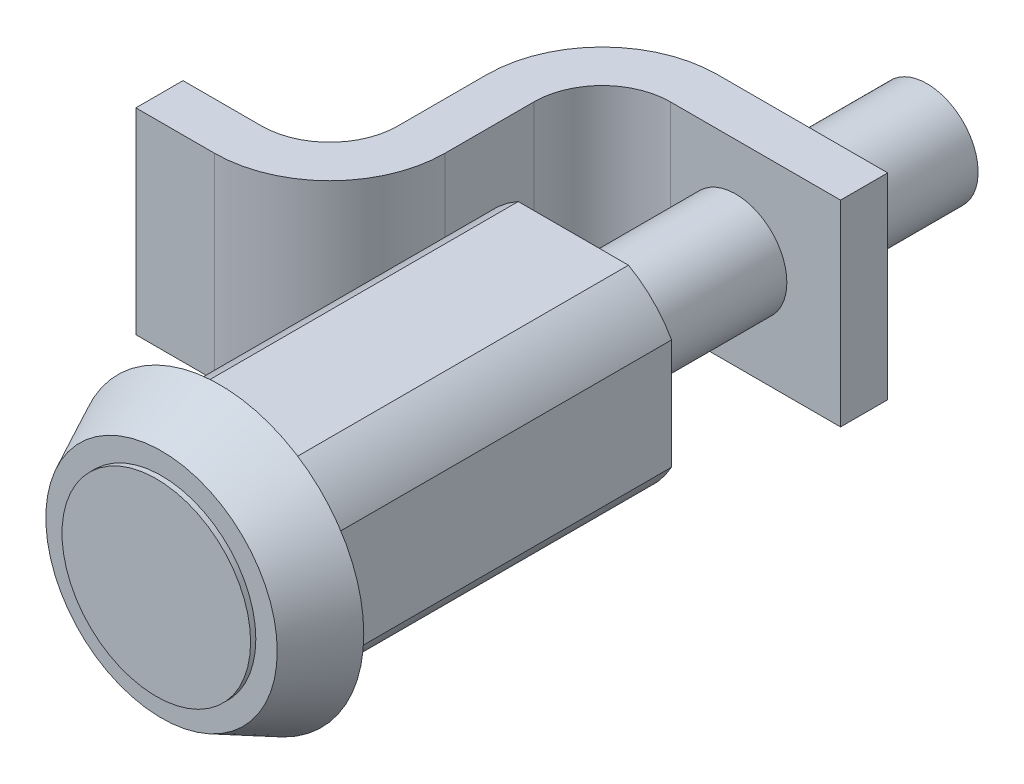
ISO-10303-21;
HEADER;
FILE_DESCRIPTION(('STEP AP214'),'2;1');
FILE_NAME('part.step','',(''),(''),'','','');
FILE_SCHEMA(('AUTOMOTIVE_DESIGN { 1 0 10303 214 1 1 1 1 }'));
ENDSEC;
DATA;
#1=APPLICATION_CONTEXT('core data for automotive mechanical design processes');
#2=APPLICATION_PROTOCOL_DEFINITION('international standard','automotive_design',2000,#1);
#3=PRODUCT_CONTEXT('',#1,'mechanical');
#4=PRODUCT('Part','Part','',(#3));
#5=PRODUCT_RELATED_PRODUCT_CATEGORY('part','',(#4));
#6=PRODUCT_DEFINITION_FORMATION('','',#4);
#7=PRODUCT_DEFINITION_CONTEXT('part definition',#1,'design');
#8=PRODUCT_DEFINITION('design','',#6,#7);
#9=PRODUCT_DEFINITION_SHAPE('','',#8);
#10=(LENGTH_UNIT() NAMED_UNIT(*) SI_UNIT(.MILLI.,.METRE.));
#11=(NAMED_UNIT(*) PLANE_ANGLE_UNIT() SI_UNIT($,.RADIAN.));
#12=(NAMED_UNIT(*) SI_UNIT($,.STERADIAN.) SOLID_ANGLE_UNIT());
#13=UNCERTAINTY_MEASURE_WITH_UNIT(LENGTH_MEASURE(1.E-05),#10,'distance_accuracy_value','');
#14=(GEOMETRIC_REPRESENTATION_CONTEXT(3) GLOBAL_UNCERTAINTY_ASSIGNED_CONTEXT((#13)) GLOBAL_UNIT_ASSIGNED_CONTEXT((#10,
#11,#12)) REPRESENTATION_CONTEXT('',''));
#15=CARTESIAN_POINT('',(0.,0.,0.));
#16=DIRECTION('',(0.,0.,1.));
#17=DIRECTION('',(1.,0.,0.));
#18=AXIS2_PLACEMENT_3D('',#15,#16,#17);
#19=CARTESIAN_POINT('',(0.,0.,0.));
#20=DIRECTION('',(0.,0.,1.));
#21=DIRECTION('',(1.,0.,0.));
#22=AXIS2_PLACEMENT_3D('',#19,#20,#21);
#23=PLANE('',#22);
#24=CARTESIAN_POINT('',(0.,0.,0.));
#25=DIRECTION('',(0.,0.,1.));
#26=DIRECTION('',(1.,0.,0.));
#27=AXIS2_PLACEMENT_3D('',#24,#25,#26);
#28=CIRCLE('',#27,13.97);
#29=CARTESIAN_POINT('',(13.97,0.,0.));
#30=VERTEX_POINT('',#29);
#31=EDGE_CURVE('E343',#30,#30,#28,.T.);
#32=ORIENTED_EDGE('',*,*,#31,.F.);
#33=EDGE_LOOP('',(#32));
#34=FACE_BOUND('',#33,.T.);
#35=CARTESIAN_POINT('',(0.,0.,0.));
#36=DIRECTION('',(0.,0.,-1.));
#37=DIRECTION('',(-1.,0.,0.));
#38=AXIS2_PLACEMENT_3D('',#35,#36,#37);
#39=CIRCLE('',#38,10.922);
#40=CARTESIAN_POINT('',(9.52500000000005,-5.34457285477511,0.));
#41=VERTEX_POINT('',#40);
#42=CARTESIAN_POINT('',(5.3445728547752,-9.525,0.));
#43=VERTEX_POINT('',#42);
#44=EDGE_CURVE('E50',#41,#43,#39,.T.);
#45=ORIENTED_EDGE('',*,*,#44,.F.);
#46=DIRECTION('',(0.,-1.,0.));
#47=VECTOR('',#46,1.);
#48=CARTESIAN_POINT('',(9.52500000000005,-5.34457285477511,0.));
#49=LINE('',#48,#47);
#50=CARTESIAN_POINT('',(9.52499999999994,5.3445728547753,0.));
#51=VERTEX_POINT('',#50);
#52=EDGE_CURVE('E54',#51,#41,#49,.T.);
#53=ORIENTED_EDGE('',*,*,#52,.F.);
#54=CARTESIAN_POINT('',(0.,0.,0.));
#55=DIRECTION('',(0.,0.,-1.));
#56=DIRECTION('',(-1.,0.,0.));
#57=AXIS2_PLACEMENT_3D('',#54,#55,#56);
#58=CIRCLE('',#57,10.922);
#59=CARTESIAN_POINT('',(5.3445728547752,9.525,0.));
#60=VERTEX_POINT('',#59);
#61=EDGE_CURVE('E314',#60,#51,#58,.T.);
#62=ORIENTED_EDGE('',*,*,#61,.F.);
#63=DIRECTION('',(1.,0.,0.));
#64=VECTOR('',#63,1.);
#65=CARTESIAN_POINT('',(5.3445728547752,9.525,0.));
#66=LINE('',#65,#64);
#67=CARTESIAN_POINT('',(-5.34457285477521,9.525,0.));
#68=VERTEX_POINT('',#67);
#69=EDGE_CURVE('E311',#68,#60,#66,.T.);
#70=ORIENTED_EDGE('',*,*,#69,.F.);
#71=CARTESIAN_POINT('',(0.,0.,0.));
#72=DIRECTION('',(0.,0.,-1.));
#73=DIRECTION('',(-1.,0.,0.));
#74=AXIS2_PLACEMENT_3D('',#71,#72,#73);
#75=CIRCLE('',#74,10.922);
#76=CARTESIAN_POINT('',(-9.52500000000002,5.34457285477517,0.));
#77=VERTEX_POINT('',#76);
#78=EDGE_CURVE('E308',#77,#68,#75,.T.);
#79=ORIENTED_EDGE('',*,*,#78,.F.);
#80=DIRECTION('',(0.,1.,0.));
#81=VECTOR('',#80,1.);
#82=CARTESIAN_POINT('',(-9.52500000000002,5.34457285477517,0.));
#83=LINE('',#82,#81);
#84=CARTESIAN_POINT('',(-9.52499999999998,-5.34457285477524,0.));
#85=VERTEX_POINT('',#84);
#86=EDGE_CURVE('E305',#85,#77,#83,.T.);
#87=ORIENTED_EDGE('',*,*,#86,.F.);
#88=CARTESIAN_POINT('',(0.,0.,0.));
#89=DIRECTION('',(0.,0.,-1.));
#90=DIRECTION('',(-1.,0.,0.));
#91=AXIS2_PLACEMENT_3D('',#88,#89,#90);
#92=CIRCLE('',#91,10.922);
#93=CARTESIAN_POINT('',(-5.3445728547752,-9.525,0.));
#94=VERTEX_POINT('',#93);
#95=EDGE_CURVE('E302',#94,#85,#92,.T.);
#96=ORIENTED_EDGE('',*,*,#95,.F.);
#97=DIRECTION('',(-1.,0.,0.));
#98=VECTOR('',#97,1.);
#99=CARTESIAN_POINT('',(-5.3445728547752,-9.525,0.));
#100=LINE('',#99,#98);
#101=EDGE_CURVE('E299',#43,#94,#100,.T.);
#102=ORIENTED_EDGE('',*,*,#101,.F.);
#103=EDGE_LOOP('',(#45,#53,#62,#70,#79,#87,#96,#102));
#104=FACE_BOUND('',#103,.T.);
#105=ADVANCED_FACE('F33',(#34,#104),#23,.F.);
#106=CARTESIAN_POINT('',(0.,0.,0.));
#107=DIRECTION('',(0.,0.,-1.));
#108=DIRECTION('',(1.,0.,0.));
#109=AXIS2_PLACEMENT_3D('',#106,#107,#108);
#110=CONICAL_SURFACE('',#109,13.97,0.453785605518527);
#111=CARTESIAN_POINT('',(0.,0.,5.6388));
#112=DIRECTION('',(0.,0.,1.));
#113=DIRECTION('',(1.,0.,0.));
#114=AXIS2_PLACEMENT_3D('',#111,#112,#113);
#115=CIRCLE('',#114,11.2197734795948);
#116=CARTESIAN_POINT('',(11.2197734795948,0.,5.6388));
#117=VERTEX_POINT('',#116);
#118=EDGE_CURVE('E346',#117,#117,#115,.T.);
#119=ORIENTED_EDGE('',*,*,#118,.F.);
#120=EDGE_LOOP('',(#119));
#121=FACE_BOUND('',#120,.T.);
#122=ORIENTED_EDGE('',*,*,#31,.T.);
#123=EDGE_LOOP('',(#122));
#124=FACE_BOUND('',#123,.T.);
#125=ADVANCED_FACE('F35',(#121,#124),#110,.T.);
#126=CARTESIAN_POINT('',(0.,0.,5.6388));
#127=DIRECTION('',(0.,0.,1.));
#128=DIRECTION('',(1.,0.,0.));
#129=AXIS2_PLACEMENT_3D('',#126,#127,#128);
#130=PLANE('',#129);
#131=CARTESIAN_POINT('',(0.,0.,5.6388));
#132=DIRECTION('',(0.,0.,1.));
#133=DIRECTION('',(1.,0.,0.));
#134=AXIS2_PLACEMENT_3D('',#131,#132,#133);
#135=CIRCLE('',#134,9.144);
#136=CARTESIAN_POINT('',(9.144,0.,5.6388));
#137=VERTEX_POINT('',#136);
#138=EDGE_CURVE('E42',#137,#137,#135,.T.);
#139=ORIENTED_EDGE('',*,*,#138,.F.);
#140=EDGE_LOOP('',(#139));
#141=FACE_BOUND('',#140,.T.);
#142=ORIENTED_EDGE('',*,*,#118,.T.);
#143=EDGE_LOOP('',(#142));
#144=FACE_BOUND('',#143,.T.);
#145=ADVANCED_FACE('F379',(#141,#144),#130,.T.);
#146=CARTESIAN_POINT('',(0.,0.,6.1468));
#147=DIRECTION('',(0.,0.,-1.));
#148=DIRECTION('',(-1.,0.,0.));
#149=AXIS2_PLACEMENT_3D('',#146,#147,#148);
#150=CYLINDRICAL_SURFACE('',#149,9.144);
#151=CARTESIAN_POINT('',(0.,0.,6.1468));
#152=DIRECTION('',(0.,0.,1.));
#153=DIRECTION('',(1.,0.,0.));
#154=AXIS2_PLACEMENT_3D('',#151,#152,#153);
#155=CIRCLE('',#154,9.144);
#156=CARTESIAN_POINT('',(9.144,0.,6.1468));
#157=VERTEX_POINT('',#156);
#158=EDGE_CURVE('E340',#157,#157,#155,.T.);
#159=ORIENTED_EDGE('',*,*,#158,.F.);
#160=EDGE_LOOP('',(#159));
#161=FACE_BOUND('',#160,.T.);
#162=ORIENTED_EDGE('',*,*,#138,.T.);
#163=EDGE_LOOP('',(#162));
#164=FACE_BOUND('',#163,.T.);
#165=ADVANCED_FACE('F385',(#161,#164),#150,.T.);
#166=CARTESIAN_POINT('',(0.,0.,6.1468));
#167=DIRECTION('',(0.,0.,1.));
#168=DIRECTION('',(1.,0.,0.));
#169=AXIS2_PLACEMENT_3D('',#166,#167,#168);
#170=PLANE('',#169);
#171=ORIENTED_EDGE('',*,*,#158,.T.);
#172=EDGE_LOOP('',(#171));
#173=FACE_BOUND('',#172,.T.);
#174=ADVANCED_FACE('F389',(#173),#170,.T.);
#175=CARTESIAN_POINT('',(0.,0.,-34.29));
#176=DIRECTION('',(0.,0.,1.));
#177=DIRECTION('',(1.,0.,0.));
#178=AXIS2_PLACEMENT_3D('',#175,#176,#177);
#179=CYLINDRICAL_SURFACE('',#178,10.922);
#180=ORIENTED_EDGE('',*,*,#44,.T.);
#181=DIRECTION('',(0.,0.,1.));
#182=VECTOR('',#181,1.);
#183=CARTESIAN_POINT('',(5.3445728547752,-9.525,-34.29));
#184=LINE('',#183,#182);
#185=CARTESIAN_POINT('',(5.3445728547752,-9.525,-34.29));
#186=VERTEX_POINT('',#185);
#187=EDGE_CURVE('E337',#186,#43,#184,.T.);
#188=ORIENTED_EDGE('',*,*,#187,.F.);
#189=CARTESIAN_POINT('',(0.,0.,-34.29));
#190=DIRECTION('',(0.,0.,-1.));
#191=DIRECTION('',(-1.,0.,0.));
#192=AXIS2_PLACEMENT_3D('',#189,#190,#191);
#193=CIRCLE('',#192,10.922);
#194=CARTESIAN_POINT('',(9.52500000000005,-5.34457285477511,-34.29));
#195=VERTEX_POINT('',#194);
#196=EDGE_CURVE('E280',#195,#186,#193,.T.);
#197=ORIENTED_EDGE('',*,*,#196,.F.);
#198=DIRECTION('',(0.,0.,1.));
#199=VECTOR('',#198,1.);
#200=CARTESIAN_POINT('',(9.52500000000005,-5.34457285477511,-34.29));
#201=LINE('',#200,#199);
#202=EDGE_CURVE('E297',#195,#41,#201,.T.);
#203=ORIENTED_EDGE('',*,*,#202,.T.);
#204=EDGE_LOOP('',(#180,#188,#197,#203));
#205=FACE_BOUND('',#204,.T.);
#206=ADVANCED_FACE('F393',(#205),#179,.T.);
#207=CARTESIAN_POINT('',(-5.3445728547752,-9.525,-34.29));
#208=DIRECTION('',(0.,1.,0.));
#209=DIRECTION('',(0.,0.,1.));
#210=AXIS2_PLACEMENT_3D('',#207,#208,#209);
#211=PLANE('',#210);
#212=ORIENTED_EDGE('',*,*,#101,.T.);
#213=DIRECTION('',(0.,0.,1.));
#214=VECTOR('',#213,1.);
#215=CARTESIAN_POINT('',(-5.3445728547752,-9.525,-34.29));
#216=LINE('',#215,#214);
#217=CARTESIAN_POINT('',(-5.3445728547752,-9.525,-34.29));
#218=VERTEX_POINT('',#217);
#219=EDGE_CURVE('E334',#218,#94,#216,.T.);
#220=ORIENTED_EDGE('',*,*,#219,.F.);
#221=DIRECTION('',(-1.,0.,0.));
#222=VECTOR('',#221,1.);
#223=CARTESIAN_POINT('',(-5.3445728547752,-9.525,-34.29));
#224=LINE('',#223,#222);
#225=EDGE_CURVE('E283',#186,#218,#224,.T.);
#226=ORIENTED_EDGE('',*,*,#225,.F.);
#227=ORIENTED_EDGE('',*,*,#187,.T.);
#228=EDGE_LOOP('',(#212,#220,#226,#227));
#229=FACE_BOUND('',#228,.T.);
#230=ADVANCED_FACE('F397',(#229),#211,.F.);
#231=CARTESIAN_POINT('',(0.,0.,-34.29));
#232=DIRECTION('',(0.,0.,1.));
#233=DIRECTION('',(1.,0.,0.));
#234=AXIS2_PLACEMENT_3D('',#231,#232,#233);
#235=CYLINDRICAL_SURFACE('',#234,10.922);
#236=ORIENTED_EDGE('',*,*,#95,.T.);
#237=DIRECTION('',(0.,0.,1.));
#238=VECTOR('',#237,1.);
#239=CARTESIAN_POINT('',(-9.52499999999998,-5.34457285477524,-34.29));
#240=LINE('',#239,#238);
#241=CARTESIAN_POINT('',(-9.52499999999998,-5.34457285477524,-34.29));
#242=VERTEX_POINT('',#241);
#243=EDGE_CURVE('E331',#242,#85,#240,.T.);
#244=ORIENTED_EDGE('',*,*,#243,.F.);
#245=CARTESIAN_POINT('',(0.,0.,-34.29));
#246=DIRECTION('',(0.,0.,-1.));
#247=DIRECTION('',(-1.,0.,0.));
#248=AXIS2_PLACEMENT_3D('',#245,#246,#247);
#249=CIRCLE('',#248,10.922);
#250=EDGE_CURVE('E285',#218,#242,#249,.T.);
#251=ORIENTED_EDGE('',*,*,#250,.F.);
#252=ORIENTED_EDGE('',*,*,#219,.T.);
#253=EDGE_LOOP('',(#236,#244,#251,#252));
#254=FACE_BOUND('',#253,.T.);
#255=ADVANCED_FACE('F401',(#254),#235,.T.);
#256=CARTESIAN_POINT('',(-9.52500000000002,5.34457285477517,-34.29));
#257=DIRECTION('',(1.,0.,0.));
#258=DIRECTION('',(0.,1.,0.));
#259=AXIS2_PLACEMENT_3D('',#256,#257,#258);
#260=PLANE('',#259);
#261=ORIENTED_EDGE('',*,*,#86,.T.);
#262=DIRECTION('',(0.,0.,1.));
#263=VECTOR('',#262,1.);
#264=CARTESIAN_POINT('',(-9.52500000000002,5.34457285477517,-34.29));
#265=LINE('',#264,#263);
#266=CARTESIAN_POINT('',(-9.52500000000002,5.34457285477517,-34.29));
#267=VERTEX_POINT('',#266);
#268=EDGE_CURVE('E328',#267,#77,#265,.T.);
#269=ORIENTED_EDGE('',*,*,#268,.F.);
#270=DIRECTION('',(0.,1.,0.));
#271=VECTOR('',#270,1.);
#272=CARTESIAN_POINT('',(-9.52500000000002,5.34457285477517,-34.29));
#273=LINE('',#272,#271);
#274=EDGE_CURVE('E287',#242,#267,#273,.T.);
#275=ORIENTED_EDGE('',*,*,#274,.F.);
#276=ORIENTED_EDGE('',*,*,#243,.T.);
#277=EDGE_LOOP('',(#261,#269,#275,#276));
#278=FACE_BOUND('',#277,.T.);
#279=ADVANCED_FACE('F405',(#278),#260,.F.);
#280=CARTESIAN_POINT('',(0.,0.,-34.29));
#281=DIRECTION('',(0.,0.,1.));
#282=DIRECTION('',(1.,0.,0.));
#283=AXIS2_PLACEMENT_3D('',#280,#281,#282);
#284=CYLINDRICAL_SURFACE('',#283,10.922);
#285=ORIENTED_EDGE('',*,*,#78,.T.);
#286=DIRECTION('',(0.,0.,1.));
#287=VECTOR('',#286,1.);
#288=CARTESIAN_POINT('',(-5.34457285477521,9.525,-34.29));
#289=LINE('',#288,#287);
#290=CARTESIAN_POINT('',(-5.34457285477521,9.525,-34.29));
#291=VERTEX_POINT('',#290);
#292=EDGE_CURVE('E325',#291,#68,#289,.T.);
#293=ORIENTED_EDGE('',*,*,#292,.F.);
#294=CARTESIAN_POINT('',(0.,0.,-34.29));
#295=DIRECTION('',(0.,0.,-1.));
#296=DIRECTION('',(-1.,0.,0.));
#297=AXIS2_PLACEMENT_3D('',#294,#295,#296);
#298=CIRCLE('',#297,10.922);
#299=EDGE_CURVE('E289',#267,#291,#298,.T.);
#300=ORIENTED_EDGE('',*,*,#299,.F.);
#301=ORIENTED_EDGE('',*,*,#268,.T.);
#302=EDGE_LOOP('',(#285,#293,#300,#301));
#303=FACE_BOUND('',#302,.T.);
#304=ADVANCED_FACE('F409',(#303),#284,.T.);
#305=CARTESIAN_POINT('',(5.3445728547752,9.525,-34.29));
#306=DIRECTION('',(0.,-1.,0.));
#307=DIRECTION('',(0.,0.,-1.));
#308=AXIS2_PLACEMENT_3D('',#305,#306,#307);
#309=PLANE('',#308);
#310=ORIENTED_EDGE('',*,*,#69,.T.);
#311=DIRECTION('',(0.,0.,1.));
#312=VECTOR('',#311,1.);
#313=CARTESIAN_POINT('',(5.3445728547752,9.525,-34.29));
#314=LINE('',#313,#312);
#315=CARTESIAN_POINT('',(5.3445728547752,9.525,-34.29));
#316=VERTEX_POINT('',#315);
#317=EDGE_CURVE('E322',#316,#60,#314,.T.);
#318=ORIENTED_EDGE('',*,*,#317,.F.);
#319=DIRECTION('',(1.,0.,0.));
#320=VECTOR('',#319,1.);
#321=CARTESIAN_POINT('',(5.3445728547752,9.525,-34.29));
#322=LINE('',#321,#320);
#323=EDGE_CURVE('E291',#291,#316,#322,.T.);
#324=ORIENTED_EDGE('',*,*,#323,.F.);
#325=ORIENTED_EDGE('',*,*,#292,.T.);
#326=EDGE_LOOP('',(#310,#318,#324,#325));
#327=FACE_BOUND('',#326,.T.);
#328=ADVANCED_FACE('F413',(#327),#309,.F.);
#329=CARTESIAN_POINT('',(0.,0.,-34.29));
#330=DIRECTION('',(0.,0.,1.));
#331=DIRECTION('',(1.,0.,0.));
#332=AXIS2_PLACEMENT_3D('',#329,#330,#331);
#333=CYLINDRICAL_SURFACE('',#332,10.922);
#334=ORIENTED_EDGE('',*,*,#61,.T.);
#335=DIRECTION('',(0.,0.,1.));
#336=VECTOR('',#335,1.);
#337=CARTESIAN_POINT('',(9.52499999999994,5.3445728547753,-34.29));
#338=LINE('',#337,#336);
#339=CARTESIAN_POINT('',(9.52499999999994,5.3445728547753,-34.29));
#340=VERTEX_POINT('',#339);
#341=EDGE_CURVE('E319',#340,#51,#338,.T.);
#342=ORIENTED_EDGE('',*,*,#341,.F.);
#343=CARTESIAN_POINT('',(0.,0.,-34.29));
#344=DIRECTION('',(0.,0.,-1.));
#345=DIRECTION('',(-1.,0.,0.));
#346=AXIS2_PLACEMENT_3D('',#343,#344,#345);
#347=CIRCLE('',#346,10.922);
#348=EDGE_CURVE('E293',#316,#340,#347,.T.);
#349=ORIENTED_EDGE('',*,*,#348,.F.);
#350=ORIENTED_EDGE('',*,*,#317,.T.);
#351=EDGE_LOOP('',(#334,#342,#349,#350));
#352=FACE_BOUND('',#351,.T.);
#353=ADVANCED_FACE('F417',(#352),#333,.T.);
#354=CARTESIAN_POINT('',(9.52500000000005,-5.34457285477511,-34.29));
#355=DIRECTION('',(-1.,0.,0.));
#356=DIRECTION('',(0.,-1.,0.));
#357=AXIS2_PLACEMENT_3D('',#354,#355,#356);
#358=PLANE('',#357);
#359=ORIENTED_EDGE('',*,*,#52,.T.);
#360=ORIENTED_EDGE('',*,*,#202,.F.);
#361=DIRECTION('',(0.,-1.,0.));
#362=VECTOR('',#361,1.);
#363=CARTESIAN_POINT('',(9.52500000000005,-5.34457285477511,-34.29));
#364=LINE('',#363,#362);
#365=EDGE_CURVE('E295',#340,#195,#364,.T.);
#366=ORIENTED_EDGE('',*,*,#365,.F.);
#367=ORIENTED_EDGE('',*,*,#341,.T.);
#368=EDGE_LOOP('',(#359,#360,#366,#367));
#369=FACE_BOUND('',#368,.T.);
#370=ADVANCED_FACE('F421',(#369),#358,.F.);
#371=CARTESIAN_POINT('',(0.,0.,-34.29));
#372=DIRECTION('',(0.,0.,-1.));
#373=DIRECTION('',(-1.,0.,0.));
#374=AXIS2_PLACEMENT_3D('',#371,#372,#373);
#375=PLANE('',#374);
#376=CARTESIAN_POINT('',(0.,0.,-34.29));
#377=DIRECTION('',(0.,0.,-1.));
#378=DIRECTION('',(-1.,0.,0.));
#379=AXIS2_PLACEMENT_3D('',#376,#377,#378);
#380=CIRCLE('',#379,4.953);
#381=CARTESIAN_POINT('',(-4.953,0.,-34.29));
#382=VERTEX_POINT('',#381);
#383=EDGE_CURVE('E11',#382,#382,#380,.T.);
#384=ORIENTED_EDGE('',*,*,#383,.F.);
#385=EDGE_LOOP('',(#384));
#386=FACE_BOUND('',#385,.T.);
#387=ORIENTED_EDGE('',*,*,#196,.T.);
#388=ORIENTED_EDGE('',*,*,#225,.T.);
#389=ORIENTED_EDGE('',*,*,#250,.T.);
#390=ORIENTED_EDGE('',*,*,#274,.T.);
#391=ORIENTED_EDGE('',*,*,#299,.T.);
#392=ORIENTED_EDGE('',*,*,#323,.T.);
#393=ORIENTED_EDGE('',*,*,#348,.T.);
#394=ORIENTED_EDGE('',*,*,#365,.T.);
#395=EDGE_LOOP('',(#387,#388,#389,#390,#391,#392,#393,#394));
#396=FACE_BOUND('',#395,.T.);
#397=ADVANCED_FACE('F370',(#386,#396),#375,.T.);
#398=CARTESIAN_POINT('',(0.,0.,-68.58));
#399=DIRECTION('',(0.,0.,1.));
#400=DIRECTION('',(1.,0.,0.));
#401=AXIS2_PLACEMENT_3D('',#398,#399,#400);
#402=CYLINDRICAL_SURFACE('',#401,4.953);
#403=CARTESIAN_POINT('',(0.,0.,-50.038));
#404=DIRECTION('',(0.,0.,1.));
#405=DIRECTION('',(1.,0.,0.));
#406=AXIS2_PLACEMENT_3D('',#403,#404,#405);
#407=CIRCLE('',#406,4.953);
#408=CARTESIAN_POINT('',(4.953,0.,-50.038));
#409=VERTEX_POINT('',#408);
#410=EDGE_CURVE('E257',#409,#409,#407,.T.);
#411=ORIENTED_EDGE('',*,*,#410,.T.);
#412=EDGE_LOOP('',(#411));
#413=FACE_BOUND('',#412,.T.);
#414=ORIENTED_EDGE('',*,*,#383,.T.);
#415=EDGE_LOOP('',(#414));
#416=FACE_BOUND('',#415,.T.);
#417=ADVANCED_FACE('F361',(#413,#416),#402,.T.);
#418=CARTESIAN_POINT('',(-6.35,-9.525,-54.61));
#419=DIRECTION('',(0.,0.,-1.));
#420=DIRECTION('',(-1.,0.,0.));
#421=AXIS2_PLACEMENT_3D('',#418,#419,#420);
#422=PLANE('',#421);
#423=CARTESIAN_POINT('',(0.,0.,-54.61));
#424=DIRECTION('',(0.,0.,-1.));
#425=DIRECTION('',(-1.,0.,0.));
#426=AXIS2_PLACEMENT_3D('',#423,#424,#425);
#427=CIRCLE('',#426,4.953);
#428=CARTESIAN_POINT('',(-4.953,0.,-54.61));
#429=VERTEX_POINT('',#428);
#430=EDGE_CURVE('E37',#429,#429,#427,.T.);
#431=ORIENTED_EDGE('',*,*,#430,.F.);
#432=EDGE_LOOP('',(#431));
#433=FACE_BOUND('',#432,.T.);
#434=DIRECTION('',(0.,1.,0.));
#435=VECTOR('',#434,1.);
#436=CARTESIAN_POINT('',(-6.35,-9.525,-54.61));
#437=LINE('',#436,#435);
#438=CARTESIAN_POINT('',(-6.35,-9.525,-54.61));
#439=VERTEX_POINT('',#438);
#440=CARTESIAN_POINT('',(-6.35,9.525,-54.61));
#441=VERTEX_POINT('',#440);
#442=EDGE_CURVE('E170',#439,#441,#437,.T.);
#443=ORIENTED_EDGE('',*,*,#442,.T.);
#444=DIRECTION('',(-1.,0.,0.));
#445=VECTOR('',#444,1.);
#446=CARTESIAN_POINT('',(-6.35,9.525,-54.61));
#447=LINE('',#446,#445);
#448=CARTESIAN_POINT('',(10.16,9.525,-54.61));
#449=VERTEX_POINT('',#448);
#450=EDGE_CURVE('E174',#449,#441,#447,.T.);
#451=ORIENTED_EDGE('',*,*,#450,.F.);
#452=DIRECTION('',(0.,1.,0.));
#453=VECTOR('',#452,1.);
#454=CARTESIAN_POINT('',(10.16,-9.525,-54.61));
#455=LINE('',#454,#453);
#456=CARTESIAN_POINT('',(10.16,-9.525,-54.61));
#457=VERTEX_POINT('',#456);
#458=EDGE_CURVE('E255',#457,#449,#455,.T.);
#459=ORIENTED_EDGE('',*,*,#458,.F.);
#460=DIRECTION('',(-1.,0.,0.));
#461=VECTOR('',#460,1.);
#462=CARTESIAN_POINT('',(-6.35,-9.525,-54.61));
#463=LINE('',#462,#461);
#464=EDGE_CURVE('E176',#457,#439,#463,.T.);
#465=ORIENTED_EDGE('',*,*,#464,.T.);
#466=EDGE_LOOP('',(#443,#451,#459,#465));
#467=FACE_BOUND('',#466,.T.);
#468=ADVANCED_FACE('F172',(#433,#467),#422,.T.);
#469=CARTESIAN_POINT('',(10.16,-9.525,-54.61));
#470=DIRECTION('',(1.,0.,0.));
#471=DIRECTION('',(0.,0.,-1.));
#472=AXIS2_PLACEMENT_3D('',#469,#470,#471);
#473=PLANE('',#472);
#474=ORIENTED_EDGE('',*,*,#458,.T.);
#475=DIRECTION('',(0.,0.,-1.));
#476=VECTOR('',#475,1.);
#477=CARTESIAN_POINT('',(10.16,9.525,-54.61));
#478=LINE('',#477,#476);
#479=CARTESIAN_POINT('',(10.16,9.525,-50.038));
#480=VERTEX_POINT('',#479);
#481=EDGE_CURVE('E195',#480,#449,#478,.T.);
#482=ORIENTED_EDGE('',*,*,#481,.F.);
#483=DIRECTION('',(0.,1.,0.));
#484=VECTOR('',#483,1.);
#485=CARTESIAN_POINT('',(10.16,-9.525,-50.038));
#486=LINE('',#485,#484);
#487=CARTESIAN_POINT('',(10.16,-9.525,-50.038));
#488=VERTEX_POINT('',#487);
#489=EDGE_CURVE('E258',#488,#480,#486,.T.);
#490=ORIENTED_EDGE('',*,*,#489,.F.);
#491=DIRECTION('',(0.,0.,-1.));
#492=VECTOR('',#491,1.);
#493=CARTESIAN_POINT('',(10.16,-9.525,-54.61));
#494=LINE('',#493,#492);
#495=EDGE_CURVE('E181',#488,#457,#494,.T.);
#496=ORIENTED_EDGE('',*,*,#495,.T.);
#497=EDGE_LOOP('',(#474,#482,#490,#496));
#498=FACE_BOUND('',#497,.T.);
#499=ADVANCED_FACE('F360',(#498),#473,.T.);
#500=CARTESIAN_POINT('',(10.16,-9.525,-50.038));
#501=DIRECTION('',(0.,0.,1.));
#502=DIRECTION('',(1.,0.,0.));
#503=AXIS2_PLACEMENT_3D('',#500,#501,#502);
#504=PLANE('',#503);
#505=ORIENTED_EDGE('',*,*,#410,.F.);
#506=EDGE_LOOP('',(#505));
#507=FACE_BOUND('',#506,.T.);
#508=ORIENTED_EDGE('',*,*,#489,.T.);
#509=DIRECTION('',(1.,0.,0.));
#510=VECTOR('',#509,1.);
#511=CARTESIAN_POINT('',(10.16,9.525,-50.038));
#512=LINE('',#511,#510);
#513=CARTESIAN_POINT('',(-6.35,9.525,-50.038));
#514=VERTEX_POINT('',#513);
#515=EDGE_CURVE('E220',#514,#480,#512,.T.);
#516=ORIENTED_EDGE('',*,*,#515,.F.);
#517=DIRECTION('',(0.,1.,0.));
#518=VECTOR('',#517,1.);
#519=CARTESIAN_POINT('',(-6.35,-9.525,-50.038));
#520=LINE('',#519,#518);
#521=CARTESIAN_POINT('',(-6.35,-9.525,-50.038));
#522=VERTEX_POINT('',#521);
#523=EDGE_CURVE('E260',#522,#514,#520,.T.);
#524=ORIENTED_EDGE('',*,*,#523,.F.);
#525=DIRECTION('',(1.,0.,0.));
#526=VECTOR('',#525,1.);
#527=CARTESIAN_POINT('',(10.16,-9.525,-50.038));
#528=LINE('',#527,#526);
#529=EDGE_CURVE('E250',#522,#488,#528,.T.);
#530=ORIENTED_EDGE('',*,*,#529,.T.);
#531=EDGE_LOOP('',(#508,#516,#524,#530));
#532=FACE_BOUND('',#531,.T.);
#533=ADVANCED_FACE('F367',(#507,#532),#504,.T.);
#534=CARTESIAN_POINT('',(-6.35,-9.525,-43.434));
#535=DIRECTION('',(0.,1.,0.));
#536=DIRECTION('',(0.,0.,1.));
#537=AXIS2_PLACEMENT_3D('',#534,#535,#536);
#538=CYLINDRICAL_SURFACE('',#537,6.604);
#539=ORIENTED_EDGE('',*,*,#523,.T.);
#540=CARTESIAN_POINT('',(-6.35,9.525,-43.434));
#541=DIRECTION('',(0.,-1.,0.));
#542=DIRECTION('',(0.,0.,-1.));
#543=AXIS2_PLACEMENT_3D('',#540,#541,#542);
#544=CIRCLE('',#543,6.604);
#545=CARTESIAN_POINT('',(-12.954,9.525,-43.434));
#546=VERTEX_POINT('',#545);
#547=EDGE_CURVE('E217',#546,#514,#544,.T.);
#548=ORIENTED_EDGE('',*,*,#547,.F.);
#549=DIRECTION('',(0.,1.,0.));
#550=VECTOR('',#549,1.);
#551=CARTESIAN_POINT('',(-12.954,-9.525,-43.434));
#552=LINE('',#551,#550);
#553=CARTESIAN_POINT('',(-12.954,-9.525,-43.434));
#554=VERTEX_POINT('',#553);
#555=EDGE_CURVE('E262',#554,#546,#552,.T.);
#556=ORIENTED_EDGE('',*,*,#555,.F.);
#557=CARTESIAN_POINT('',(-6.35,-9.525,-43.434));
#558=DIRECTION('',(0.,-1.,0.));
#559=DIRECTION('',(0.,0.,-1.));
#560=AXIS2_PLACEMENT_3D('',#557,#558,#559);
#561=CIRCLE('',#560,6.604);
#562=EDGE_CURVE('E247',#554,#522,#561,.T.);
#563=ORIENTED_EDGE('',*,*,#562,.T.);
#564=EDGE_LOOP('',(#539,#548,#556,#563));
#565=FACE_BOUND('',#564,.T.);
#566=ADVANCED_FACE('F446',(#565),#538,.F.);
#567=CARTESIAN_POINT('',(-12.954,-9.525,-34.798));
#568=DIRECTION('',(1.,0.,0.));
#569=DIRECTION('',(0.,0.,-1.));
#570=AXIS2_PLACEMENT_3D('',#567,#568,#569);
#571=PLANE('',#570);
#572=ORIENTED_EDGE('',*,*,#555,.T.);
#573=DIRECTION('',(0.,0.,-1.));
#574=VECTOR('',#573,1.);
#575=CARTESIAN_POINT('',(-12.954,9.525,-34.798));
#576=LINE('',#575,#574);
#577=CARTESIAN_POINT('',(-12.954,9.525,-34.798));
#578=VERTEX_POINT('',#577);
#579=EDGE_CURVE('E214',#578,#546,#576,.T.);
#580=ORIENTED_EDGE('',*,*,#579,.F.);
#581=DIRECTION('',(0.,1.,0.));
#582=VECTOR('',#581,1.);
#583=CARTESIAN_POINT('',(-12.954,-9.525,-34.798));
#584=LINE('',#583,#582);
#585=CARTESIAN_POINT('',(-12.954,-9.525,-34.798));
#586=VERTEX_POINT('',#585);
#587=EDGE_CURVE('E264',#586,#578,#584,.T.);
#588=ORIENTED_EDGE('',*,*,#587,.F.);
#589=DIRECTION('',(0.,0.,-1.));
#590=VECTOR('',#589,1.);
#591=CARTESIAN_POINT('',(-12.954,-9.525,-34.798));
#592=LINE('',#591,#590);
#593=EDGE_CURVE('E244',#586,#554,#592,.T.);
#594=ORIENTED_EDGE('',*,*,#593,.T.);
#595=EDGE_LOOP('',(#572,#580,#588,#594));
#596=FACE_BOUND('',#595,.T.);
#597=ADVANCED_FACE('F450',(#596),#571,.T.);
#598=CARTESIAN_POINT('',(-24.13,-9.525,-34.798));
#599=DIRECTION('',(0.,1.,0.));
#600=DIRECTION('',(0.,0.,1.));
#601=AXIS2_PLACEMENT_3D('',#598,#599,#600);
#602=CYLINDRICAL_SURFACE('',#601,11.176);
#603=ORIENTED_EDGE('',*,*,#587,.T.);
#604=CARTESIAN_POINT('',(-24.13,9.525,-34.798));
#605=DIRECTION('',(0.,1.,0.));
#606=DIRECTION('',(0.,0.,-1.));
#607=AXIS2_PLACEMENT_3D('',#604,#605,#606);
#608=CIRCLE('',#607,11.176);
#609=CARTESIAN_POINT('',(-24.13,9.525,-23.622));
#610=VERTEX_POINT('',#609);
#611=EDGE_CURVE('E211',#610,#578,#608,.T.);
#612=ORIENTED_EDGE('',*,*,#611,.F.);
#613=DIRECTION('',(0.,1.,0.));
#614=VECTOR('',#613,1.);
#615=CARTESIAN_POINT('',(-24.13,-9.525,-23.622));
#616=LINE('',#615,#614);
#617=CARTESIAN_POINT('',(-24.13,-9.525,-23.622));
#618=VERTEX_POINT('',#617);
#619=EDGE_CURVE('E266',#618,#610,#616,.T.);
#620=ORIENTED_EDGE('',*,*,#619,.F.);
#621=CARTESIAN_POINT('',(-24.13,-9.525,-34.798));
#622=DIRECTION('',(0.,1.,0.));
#623=DIRECTION('',(0.,0.,-1.));
#624=AXIS2_PLACEMENT_3D('',#621,#622,#623);
#625=CIRCLE('',#624,11.176);
#626=EDGE_CURVE('E241',#618,#586,#625,.T.);
#627=ORIENTED_EDGE('',*,*,#626,.T.);
#628=EDGE_LOOP('',(#603,#612,#620,#627));
#629=FACE_BOUND('',#628,.T.);
#630=ADVANCED_FACE('F454',(#629),#602,.T.);
#631=CARTESIAN_POINT('',(-24.13,-9.525,-23.622));
#632=DIRECTION('',(0.,0.,1.));
#633=DIRECTION('',(1.,0.,0.));
#634=AXIS2_PLACEMENT_3D('',#631,#632,#633);
#635=PLANE('',#634);
#636=ORIENTED_EDGE('',*,*,#619,.T.);
#637=DIRECTION('',(1.,0.,0.));
#638=VECTOR('',#637,1.);
#639=CARTESIAN_POINT('',(-24.13,9.525,-23.622));
#640=LINE('',#639,#638);
#641=CARTESIAN_POINT('',(-31.75,9.525,-23.622));
#642=VERTEX_POINT('',#641);
#643=EDGE_CURVE('E208',#642,#610,#640,.T.);
#644=ORIENTED_EDGE('',*,*,#643,.F.);
#645=DIRECTION('',(0.,1.,0.));
#646=VECTOR('',#645,1.);
#647=CARTESIAN_POINT('',(-31.75,-9.525,-23.622));
#648=LINE('',#647,#646);
#649=CARTESIAN_POINT('',(-31.75,-9.525,-23.622));
#650=VERTEX_POINT('',#649);
#651=EDGE_CURVE('E268',#650,#642,#648,.T.);
#652=ORIENTED_EDGE('',*,*,#651,.F.);
#653=DIRECTION('',(1.,0.,0.));
#654=VECTOR('',#653,1.);
#655=CARTESIAN_POINT('',(-24.13,-9.525,-23.622));
#656=LINE('',#655,#654);
#657=EDGE_CURVE('E238',#650,#618,#656,.T.);
#658=ORIENTED_EDGE('',*,*,#657,.T.);
#659=EDGE_LOOP('',(#636,#644,#652,#658));
#660=FACE_BOUND('',#659,.T.);
#661=ADVANCED_FACE('F458',(#660),#635,.T.);
#662=CARTESIAN_POINT('',(-31.75,-9.525,-23.622));
#663=DIRECTION('',(-1.,0.,0.));
#664=DIRECTION('',(0.,0.,1.));
#665=AXIS2_PLACEMENT_3D('',#662,#663,#664);
#666=PLANE('',#665);
#667=ORIENTED_EDGE('',*,*,#651,.T.);
#668=DIRECTION('',(0.,0.,1.));
#669=VECTOR('',#668,1.);
#670=CARTESIAN_POINT('',(-31.75,9.525,-23.622));
#671=LINE('',#670,#669);
#672=CARTESIAN_POINT('',(-31.75,9.525,-28.194));
#673=VERTEX_POINT('',#672);
#674=EDGE_CURVE('E205',#673,#642,#671,.T.);
#675=ORIENTED_EDGE('',*,*,#674,.F.);
#676=DIRECTION('',(0.,1.,0.));
#677=VECTOR('',#676,1.);
#678=CARTESIAN_POINT('',(-31.75,-9.525,-28.194));
#679=LINE('',#678,#677);
#680=CARTESIAN_POINT('',(-31.75,-9.525,-28.194));
#681=VERTEX_POINT('',#680);
#682=EDGE_CURVE('E270',#681,#673,#679,.T.);
#683=ORIENTED_EDGE('',*,*,#682,.F.);
#684=DIRECTION('',(0.,0.,1.));
#685=VECTOR('',#684,1.);
#686=CARTESIAN_POINT('',(-31.75,-9.525,-23.622));
#687=LINE('',#686,#685);
#688=EDGE_CURVE('E235',#681,#650,#687,.T.);
#689=ORIENTED_EDGE('',*,*,#688,.T.);
#690=EDGE_LOOP('',(#667,#675,#683,#689));
#691=FACE_BOUND('',#690,.T.);
#692=ADVANCED_FACE('F462',(#691),#666,.T.);
#693=CARTESIAN_POINT('',(-31.75,-9.525,-28.194));
#694=DIRECTION('',(0.,0.,-1.));
#695=DIRECTION('',(-1.,0.,0.));
#696=AXIS2_PLACEMENT_3D('',#693,#694,#695);
#697=PLANE('',#696);
#698=ORIENTED_EDGE('',*,*,#682,.T.);
#699=DIRECTION('',(-1.,0.,0.));
#700=VECTOR('',#699,1.);
#701=CARTESIAN_POINT('',(-31.75,9.525,-28.194));
#702=LINE('',#701,#700);
#703=CARTESIAN_POINT('',(-24.13,9.525,-28.194));
#704=VERTEX_POINT('',#703);
#705=EDGE_CURVE('E202',#704,#673,#702,.T.);
#706=ORIENTED_EDGE('',*,*,#705,.F.);
#707=DIRECTION('',(0.,1.,0.));
#708=VECTOR('',#707,1.);
#709=CARTESIAN_POINT('',(-24.13,-9.525,-28.194));
#710=LINE('',#709,#708);
#711=CARTESIAN_POINT('',(-24.13,-9.525,-28.194));
#712=VERTEX_POINT('',#711);
#713=EDGE_CURVE('E272',#712,#704,#710,.T.);
#714=ORIENTED_EDGE('',*,*,#713,.F.);
#715=DIRECTION('',(-1.,0.,0.));
#716=VECTOR('',#715,1.);
#717=CARTESIAN_POINT('',(-31.75,-9.525,-28.194));
#718=LINE('',#717,#716);
#719=EDGE_CURVE('E232',#712,#681,#718,.T.);
#720=ORIENTED_EDGE('',*,*,#719,.T.);
#721=EDGE_LOOP('',(#698,#706,#714,#720));
#722=FACE_BOUND('',#721,.T.);
#723=ADVANCED_FACE('F466',(#722),#697,.T.);
#724=CARTESIAN_POINT('',(-24.13,-9.525,-34.798));
#725=DIRECTION('',(0.,1.,0.));
#726=DIRECTION('',(0.,0.,1.));
#727=AXIS2_PLACEMENT_3D('',#724,#725,#726);
#728=CYLINDRICAL_SURFACE('',#727,6.60400000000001);
#729=ORIENTED_EDGE('',*,*,#713,.T.);
#730=CARTESIAN_POINT('',(-24.13,9.525,-34.798));
#731=DIRECTION('',(0.,-1.,0.));
#732=DIRECTION('',(0.,0.,1.));
#733=AXIS2_PLACEMENT_3D('',#730,#731,#732);
#734=CIRCLE('',#733,6.60400000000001);
#735=CARTESIAN_POINT('',(-17.526,9.525,-34.798));
#736=VERTEX_POINT('',#735);
#737=EDGE_CURVE('E199',#736,#704,#734,.T.);
#738=ORIENTED_EDGE('',*,*,#737,.F.);
#739=DIRECTION('',(0.,1.,0.));
#740=VECTOR('',#739,1.);
#741=CARTESIAN_POINT('',(-17.526,-9.525,-34.798));
#742=LINE('',#741,#740);
#743=CARTESIAN_POINT('',(-17.526,-9.525,-34.798));
#744=VERTEX_POINT('',#743);
#745=EDGE_CURVE('E274',#744,#736,#742,.T.);
#746=ORIENTED_EDGE('',*,*,#745,.F.);
#747=CARTESIAN_POINT('',(-24.13,-9.525,-34.798));
#748=DIRECTION('',(0.,-1.,0.));
#749=DIRECTION('',(0.,0.,1.));
#750=AXIS2_PLACEMENT_3D('',#747,#748,#749);
#751=CIRCLE('',#750,6.60400000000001);
#752=EDGE_CURVE('E229',#744,#712,#751,.T.);
#753=ORIENTED_EDGE('',*,*,#752,.T.);
#754=EDGE_LOOP('',(#729,#738,#746,#753));
#755=FACE_BOUND('',#754,.T.);
#756=ADVANCED_FACE('F470',(#755),#728,.F.);
#757=CARTESIAN_POINT('',(-17.526,-9.525,-34.798));
#758=DIRECTION('',(-1.,0.,0.));
#759=DIRECTION('',(0.,0.,1.));
#760=AXIS2_PLACEMENT_3D('',#757,#758,#759);
#761=PLANE('',#760);
#762=ORIENTED_EDGE('',*,*,#745,.T.);
#763=DIRECTION('',(0.,0.,1.));
#764=VECTOR('',#763,1.);
#765=CARTESIAN_POINT('',(-17.526,9.525,-34.798));
#766=LINE('',#765,#764);
#767=CARTESIAN_POINT('',(-17.526,9.525,-43.434));
#768=VERTEX_POINT('',#767);
#769=EDGE_CURVE('E189',#768,#736,#766,.T.);
#770=ORIENTED_EDGE('',*,*,#769,.F.);
#771=DIRECTION('',(0.,1.,0.));
#772=VECTOR('',#771,1.);
#773=CARTESIAN_POINT('',(-17.526,-9.525,-43.434));
#774=LINE('',#773,#772);
#775=CARTESIAN_POINT('',(-17.526,-9.525,-43.434));
#776=VERTEX_POINT('',#775);
#777=EDGE_CURVE('E180',#776,#768,#774,.T.);
#778=ORIENTED_EDGE('',*,*,#777,.F.);
#779=DIRECTION('',(0.,0.,1.));
#780=VECTOR('',#779,1.);
#781=CARTESIAN_POINT('',(-17.526,-9.525,-34.798));
#782=LINE('',#781,#780);
#783=EDGE_CURVE('E226',#776,#744,#782,.T.);
#784=ORIENTED_EDGE('',*,*,#783,.T.);
#785=EDGE_LOOP('',(#762,#770,#778,#784));
#786=FACE_BOUND('',#785,.T.);
#787=ADVANCED_FACE('F474',(#786),#761,.T.);
#788=CARTESIAN_POINT('',(-6.35,-9.525,-43.434));
#789=DIRECTION('',(0.,1.,0.));
#790=DIRECTION('',(0.,0.,1.));
#791=AXIS2_PLACEMENT_3D('',#788,#789,#790);
#792=CYLINDRICAL_SURFACE('',#791,11.176);
#793=ORIENTED_EDGE('',*,*,#777,.T.);
#794=CARTESIAN_POINT('',(-6.35,9.525,-43.434));
#795=DIRECTION('',(0.,1.,0.));
#796=DIRECTION('',(0.,0.,-1.));
#797=AXIS2_PLACEMENT_3D('',#794,#795,#796);
#798=CIRCLE('',#797,11.176);
#799=EDGE_CURVE('E184',#441,#768,#798,.T.);
#800=ORIENTED_EDGE('',*,*,#799,.F.);
#801=ORIENTED_EDGE('',*,*,#442,.F.);
#802=CARTESIAN_POINT('',(-6.35,-9.525,-43.434));
#803=DIRECTION('',(0.,1.,0.));
#804=DIRECTION('',(0.,0.,-1.));
#805=AXIS2_PLACEMENT_3D('',#802,#803,#804);
#806=CIRCLE('',#805,11.176);
#807=EDGE_CURVE('E224',#439,#776,#806,.T.);
#808=ORIENTED_EDGE('',*,*,#807,.T.);
#809=EDGE_LOOP('',(#793,#800,#801,#808));
#810=FACE_BOUND('',#809,.T.);
#811=ADVANCED_FACE('F185',(#810),#792,.T.);
#812=CARTESIAN_POINT('',(-6.35,-9.525,-43.434));
#813=DIRECTION('',(0.,-1.,0.));
#814=DIRECTION('',(0.,0.,-1.));
#815=AXIS2_PLACEMENT_3D('',#812,#813,#814);
#816=PLANE('',#815);
#817=ORIENTED_EDGE('',*,*,#464,.F.);
#818=ORIENTED_EDGE('',*,*,#495,.F.);
#819=ORIENTED_EDGE('',*,*,#529,.F.);
#820=ORIENTED_EDGE('',*,*,#562,.F.);
#821=ORIENTED_EDGE('',*,*,#593,.F.);
#822=ORIENTED_EDGE('',*,*,#626,.F.);
#823=ORIENTED_EDGE('',*,*,#657,.F.);
#824=ORIENTED_EDGE('',*,*,#688,.F.);
#825=ORIENTED_EDGE('',*,*,#719,.F.);
#826=ORIENTED_EDGE('',*,*,#752,.F.);
#827=ORIENTED_EDGE('',*,*,#783,.F.);
#828=ORIENTED_EDGE('',*,*,#807,.F.);
#829=EDGE_LOOP('',(#817,#818,#819,#820,#821,#822,#823,#824,#825,#826,#827,#828));
#830=FACE_BOUND('',#829,.T.);
#831=ADVANCED_FACE('F435',(#830),#816,.T.);
#832=CARTESIAN_POINT('',(-6.35,9.525,-43.434));
#833=DIRECTION('',(0.,-1.,0.));
#834=DIRECTION('',(0.,0.,-1.));
#835=AXIS2_PLACEMENT_3D('',#832,#833,#834);
#836=PLANE('',#835);
#837=ORIENTED_EDGE('',*,*,#450,.T.);
#838=ORIENTED_EDGE('',*,*,#799,.T.);
#839=ORIENTED_EDGE('',*,*,#769,.T.);
#840=ORIENTED_EDGE('',*,*,#737,.T.);
#841=ORIENTED_EDGE('',*,*,#705,.T.);
#842=ORIENTED_EDGE('',*,*,#674,.T.);
#843=ORIENTED_EDGE('',*,*,#643,.T.);
#844=ORIENTED_EDGE('',*,*,#611,.T.);
#845=ORIENTED_EDGE('',*,*,#579,.T.);
#846=ORIENTED_EDGE('',*,*,#547,.T.);
#847=ORIENTED_EDGE('',*,*,#515,.T.);
#848=ORIENTED_EDGE('',*,*,#481,.T.);
#849=EDGE_LOOP('',(#837,#838,#839,#840,#841,#842,#843,#844,#845,#846,#847,#848));
#850=FACE_BOUND('',#849,.T.);
#851=ADVANCED_FACE('F192',(#850),#836,.F.);
#852=CARTESIAN_POINT('',(0.,0.,-68.58));
#853=DIRECTION('',(0.,0.,-1.));
#854=DIRECTION('',(-1.,0.,0.));
#855=AXIS2_PLACEMENT_3D('',#852,#853,#854);
#856=PLANE('',#855);
#857=CARTESIAN_POINT('',(0.,0.,-68.58));
#858=DIRECTION('',(0.,0.,-1.));
#859=DIRECTION('',(-1.,0.,0.));
#860=AXIS2_PLACEMENT_3D('',#857,#858,#859);
#861=CIRCLE('',#860,4.953);
#862=CARTESIAN_POINT('',(-4.953,0.,-68.58));
#863=VERTEX_POINT('',#862);
#864=EDGE_CURVE('E277',#863,#863,#861,.T.);
#865=ORIENTED_EDGE('',*,*,#864,.T.);
#866=EDGE_LOOP('',(#865));
#867=FACE_BOUND('',#866,.T.);
#868=ADVANCED_FACE('F428',(#867),#856,.T.);
#869=ORIENTED_EDGE('',*,*,#430,.T.);
#870=EDGE_LOOP('',(#869));
#871=FACE_BOUND('',#870,.T.);
#872=ORIENTED_EDGE('',*,*,#864,.F.);
#873=EDGE_LOOP('',(#872));
#874=FACE_BOUND('',#873,.T.);
#875=ADVANCED_FACE('F356',(#871,#874),#402,.T.);
#876=CLOSED_SHELL('',(#105,#125,#145,#165,#174,#206,#230,#255,#279,#304,#328,#353,#370,#397,
#417,#468,#499,#533,#566,#597,#630,#661,#692,#723,#756,#787,#811,#831,#851,#868,#875));
#877=MANIFOLD_SOLID_BREP('B2',#876);
#878=ADVANCED_BREP_SHAPE_REPRESENTATION('',(#18,#877),#14);
#879=SHAPE_DEFINITION_REPRESENTATION(#9,#878);
ENDSEC;
END-ISO-10303-21;
